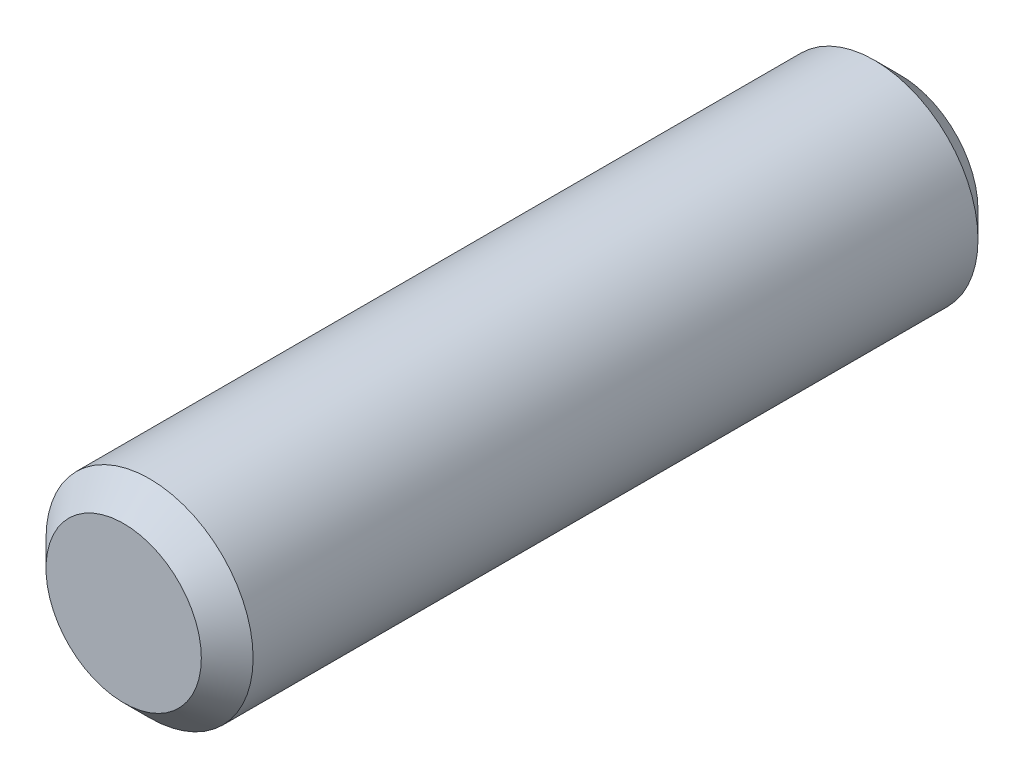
from build123d import *

# Parameters (mm, degrees)
ESQUISSE1_R        = 2
BOSS_EXTRU_1_DEPTH = 15
CHANFREIN2_SIZE    = 0.5


with BuildPart() as part:
    # Esquisse1 → Boss.-Extru.1 (new body)
    with BuildSketch(Plane.XY):
        Circle(ESQUISSE1_R)
    extrude(amount=BOSS_EXTRU_1_DEPTH)

    # Chanfrein2
    chanfrein2_edges = [part.edges().sort_by_distance(p)[0] for p in [
        (-2, 0, 0),
        (-2, 0, 15),
    ]]
    chamfer(chanfrein2_edges, length=CHANFREIN2_SIZE)


solid = part.part
